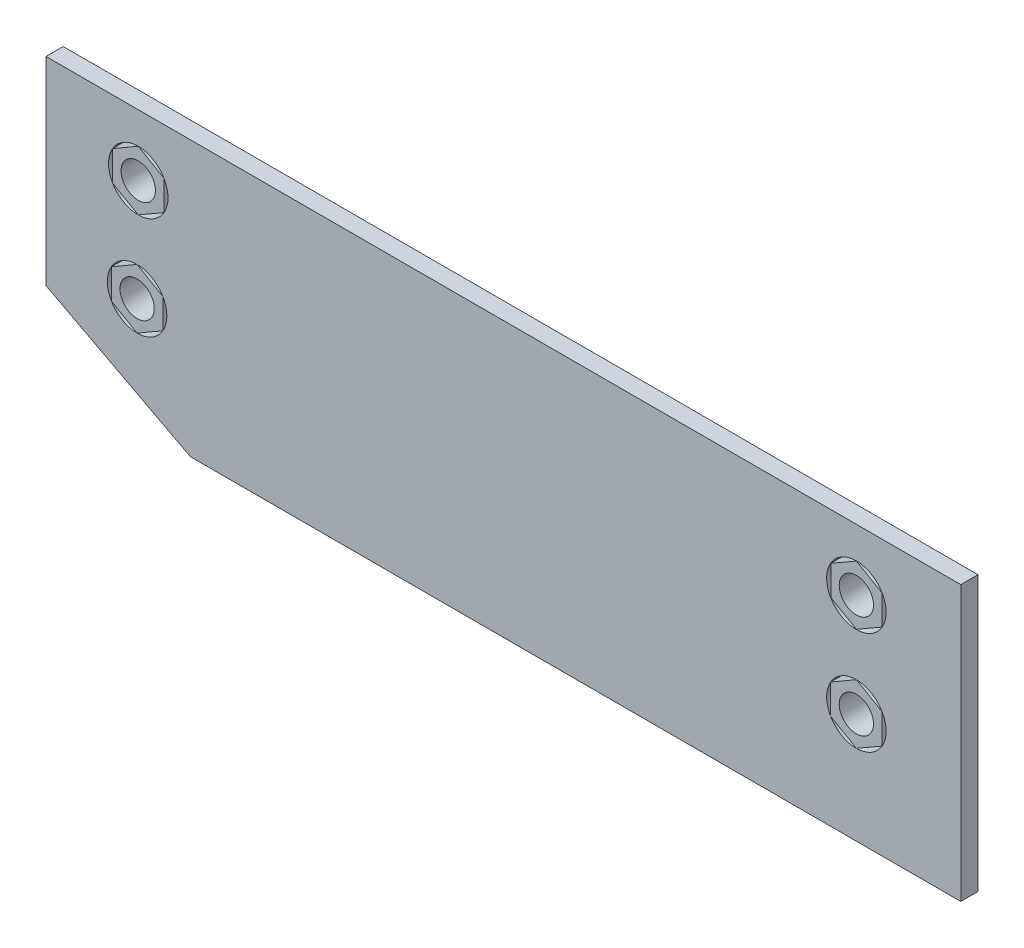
ISO-10303-21;
HEADER;
FILE_DESCRIPTION(('STEP AP214'),'2;1');
FILE_NAME('part.step','',(''),(''),'','','');
FILE_SCHEMA(('AUTOMOTIVE_DESIGN { 1 0 10303 214 1 1 1 1 }'));
ENDSEC;
DATA;
#1=APPLICATION_CONTEXT('core data for automotive mechanical design processes');
#2=APPLICATION_PROTOCOL_DEFINITION('international standard','automotive_design',2000,#1);
#3=PRODUCT_CONTEXT('',#1,'mechanical');
#4=PRODUCT('Part','Part','',(#3));
#5=PRODUCT_RELATED_PRODUCT_CATEGORY('part','',(#4));
#6=PRODUCT_DEFINITION_FORMATION('','',#4);
#7=PRODUCT_DEFINITION_CONTEXT('part definition',#1,'design');
#8=PRODUCT_DEFINITION('design','',#6,#7);
#9=PRODUCT_DEFINITION_SHAPE('','',#8);
#10=(LENGTH_UNIT() NAMED_UNIT(*) SI_UNIT(.MILLI.,.METRE.));
#11=(NAMED_UNIT(*) PLANE_ANGLE_UNIT() SI_UNIT($,.RADIAN.));
#12=(NAMED_UNIT(*) SI_UNIT($,.STERADIAN.) SOLID_ANGLE_UNIT());
#13=UNCERTAINTY_MEASURE_WITH_UNIT(LENGTH_MEASURE(1.E-05),#10,'distance_accuracy_value','');
#14=(GEOMETRIC_REPRESENTATION_CONTEXT(3) GLOBAL_UNCERTAINTY_ASSIGNED_CONTEXT((#13)) GLOBAL_UNIT_ASSIGNED_CONTEXT((#10,
#11,#12)) REPRESENTATION_CONTEXT('',''));
#15=CARTESIAN_POINT('',(0.,0.,0.));
#16=DIRECTION('',(0.,0.,1.));
#17=DIRECTION('',(1.,0.,0.));
#18=AXIS2_PLACEMENT_3D('',#15,#16,#17);
#19=CARTESIAN_POINT('',(-107.159098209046,4.12750000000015,0.));
#20=DIRECTION('',(-0.499999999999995,0.866025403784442,0.));
#21=DIRECTION('',(-0.866025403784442,-0.499999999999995,0.));
#22=AXIS2_PLACEMENT_3D('',#19,#20,#21);
#23=PLANE('',#22);
#24=DIRECTION('',(0.,0.,-1.));
#25=VECTOR('',#24,1.);
#26=CARTESIAN_POINT('',(-100.010058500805,8.25500000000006,0.));
#27=LINE('',#26,#25);
#28=CARTESIAN_POINT('',(-100.010058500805,8.25500000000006,0.));
#29=VERTEX_POINT('',#28);
#30=CARTESIAN_POINT('',(-100.010058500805,8.25500000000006,-7.3152));
#31=VERTEX_POINT('',#30);
#32=EDGE_CURVE('E65',#29,#31,#27,.T.);
#33=ORIENTED_EDGE('',*,*,#32,.T.);
#34=DIRECTION('',(0.866025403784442,0.499999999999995,0.));
#35=VECTOR('',#34,1.);
#36=CARTESIAN_POINT('',(-107.159098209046,4.12750000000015,-7.3152));
#37=LINE('',#36,#35);
#38=CARTESIAN_POINT('',(-107.159098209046,4.12750000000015,-7.3152));
#39=VERTEX_POINT('',#38);
#40=EDGE_CURVE('E114',#39,#31,#37,.T.);
#41=ORIENTED_EDGE('',*,*,#40,.F.);
#42=DIRECTION('',(0.,0.,-1.));
#43=VECTOR('',#42,1.);
#44=CARTESIAN_POINT('',(-107.159098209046,4.12750000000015,0.));
#45=LINE('',#44,#43);
#46=CARTESIAN_POINT('',(-107.159098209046,4.12750000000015,0.));
#47=VERTEX_POINT('',#46);
#48=EDGE_CURVE('E14',#47,#39,#45,.T.);
#49=ORIENTED_EDGE('',*,*,#48,.F.);
#50=DIRECTION('',(0.866025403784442,0.499999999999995,0.));
#51=VECTOR('',#50,1.);
#52=CARTESIAN_POINT('',(-107.159098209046,4.12750000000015,0.));
#53=LINE('',#52,#51);
#54=EDGE_CURVE('E115',#47,#29,#53,.T.);
#55=ORIENTED_EDGE('',*,*,#54,.T.);
#56=EDGE_LOOP('',(#33,#41,#49,#55));
#57=FACE_BOUND('',#56,.T.);
#58=ADVANCED_FACE('F62',(#57),#23,.T.);
#59=CARTESIAN_POINT('',(-107.159098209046,-4.12749999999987,0.));
#60=DIRECTION('',(-1.,0.,0.));
#61=DIRECTION('',(0.,-1.,0.));
#62=AXIS2_PLACEMENT_3D('',#59,#60,#61);
#63=PLANE('',#62);
#64=ORIENTED_EDGE('',*,*,#48,.T.);
#65=DIRECTION('',(0.,1.,0.));
#66=VECTOR('',#65,1.);
#67=CARTESIAN_POINT('',(-107.159098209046,-4.12749999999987,-7.3152));
#68=LINE('',#67,#66);
#69=CARTESIAN_POINT('',(-107.159098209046,-4.12749999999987,-7.3152));
#70=VERTEX_POINT('',#69);
#71=EDGE_CURVE('E133',#70,#39,#68,.T.);
#72=ORIENTED_EDGE('',*,*,#71,.F.);
#73=DIRECTION('',(0.,0.,-1.));
#74=VECTOR('',#73,1.);
#75=CARTESIAN_POINT('',(-107.159098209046,-4.12749999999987,0.));
#76=LINE('',#75,#74);
#77=CARTESIAN_POINT('',(-107.159098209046,-4.12749999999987,0.));
#78=VERTEX_POINT('',#77);
#79=EDGE_CURVE('E70',#78,#70,#76,.T.);
#80=ORIENTED_EDGE('',*,*,#79,.F.);
#81=DIRECTION('',(0.,1.,0.));
#82=VECTOR('',#81,1.);
#83=CARTESIAN_POINT('',(-107.159098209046,-4.12749999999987,0.));
#84=LINE('',#83,#82);
#85=EDGE_CURVE('E120',#78,#47,#84,.T.);
#86=ORIENTED_EDGE('',*,*,#85,.T.);
#87=EDGE_LOOP('',(#64,#72,#80,#86));
#88=FACE_BOUND('',#87,.T.);
#89=ADVANCED_FACE('F179',(#88),#63,.T.);
#90=CARTESIAN_POINT('',(-100.010058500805,-8.25499999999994,0.));
#91=DIRECTION('',(-0.500000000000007,-0.866025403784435,0.));
#92=DIRECTION('',(0.866025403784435,-0.500000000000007,0.));
#93=AXIS2_PLACEMENT_3D('',#90,#91,#92);
#94=PLANE('',#93);
#95=ORIENTED_EDGE('',*,*,#79,.T.);
#96=DIRECTION('',(-0.866025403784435,0.500000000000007,0.));
#97=VECTOR('',#96,1.);
#98=CARTESIAN_POINT('',(-100.010058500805,-8.25499999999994,-7.3152));
#99=LINE('',#98,#97);
#100=CARTESIAN_POINT('',(-100.010058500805,-8.25499999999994,-7.3152));
#101=VERTEX_POINT('',#100);
#102=EDGE_CURVE('E143',#101,#70,#99,.T.);
#103=ORIENTED_EDGE('',*,*,#102,.F.);
#104=DIRECTION('',(0.,0.,-1.));
#105=VECTOR('',#104,1.);
#106=CARTESIAN_POINT('',(-100.010058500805,-8.25499999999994,0.));
#107=LINE('',#106,#105);
#108=CARTESIAN_POINT('',(-100.010058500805,-8.25499999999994,0.));
#109=VERTEX_POINT('',#108);
#110=EDGE_CURVE('E162',#109,#101,#107,.T.);
#111=ORIENTED_EDGE('',*,*,#110,.F.);
#112=DIRECTION('',(-0.866025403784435,0.500000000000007,0.));
#113=VECTOR('',#112,1.);
#114=CARTESIAN_POINT('',(-100.010058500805,-8.25499999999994,0.));
#115=LINE('',#114,#113);
#116=EDGE_CURVE('E158',#109,#78,#115,.T.);
#117=ORIENTED_EDGE('',*,*,#116,.T.);
#118=EDGE_LOOP('',(#95,#103,#111,#117));
#119=FACE_BOUND('',#118,.T.);
#120=ADVANCED_FACE('F175',(#119),#94,.T.);
#121=CARTESIAN_POINT('',(-92.8610187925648,-4.12749999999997,0.));
#122=DIRECTION('',(0.499999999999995,-0.866025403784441,0.));
#123=DIRECTION('',(0.866025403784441,0.499999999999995,0.));
#124=AXIS2_PLACEMENT_3D('',#121,#122,#123);
#125=PLANE('',#124);
#126=ORIENTED_EDGE('',*,*,#110,.T.);
#127=DIRECTION('',(-0.866025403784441,-0.499999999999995,0.));
#128=VECTOR('',#127,1.);
#129=CARTESIAN_POINT('',(-92.8610187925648,-4.12749999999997,-7.3152));
#130=LINE('',#129,#128);
#131=CARTESIAN_POINT('',(-92.8610187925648,-4.12749999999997,-7.3152));
#132=VERTEX_POINT('',#131);
#133=EDGE_CURVE('E140',#132,#101,#130,.T.);
#134=ORIENTED_EDGE('',*,*,#133,.F.);
#135=DIRECTION('',(0.,0.,-1.));
#136=VECTOR('',#135,1.);
#137=CARTESIAN_POINT('',(-92.8610187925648,-4.12749999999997,0.));
#138=LINE('',#137,#136);
#139=CARTESIAN_POINT('',(-92.8610187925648,-4.12749999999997,0.));
#140=VERTEX_POINT('',#139);
#141=EDGE_CURVE('E164',#140,#132,#138,.T.);
#142=ORIENTED_EDGE('',*,*,#141,.F.);
#143=DIRECTION('',(-0.866025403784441,-0.499999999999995,0.));
#144=VECTOR('',#143,1.);
#145=CARTESIAN_POINT('',(-92.8610187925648,-4.12749999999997,0.));
#146=LINE('',#145,#144);
#147=EDGE_CURVE('E155',#140,#109,#146,.T.);
#148=ORIENTED_EDGE('',*,*,#147,.T.);
#149=EDGE_LOOP('',(#126,#134,#142,#148));
#150=FACE_BOUND('',#149,.T.);
#151=ADVANCED_FACE('F172',(#150),#125,.T.);
#152=CARTESIAN_POINT('',(-92.8610187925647,4.12750000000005,0.));
#153=DIRECTION('',(1.,0.,0.));
#154=DIRECTION('',(0.,1.,0.));
#155=AXIS2_PLACEMENT_3D('',#152,#153,#154);
#156=PLANE('',#155);
#157=ORIENTED_EDGE('',*,*,#141,.T.);
#158=DIRECTION('',(0.,-1.,0.));
#159=VECTOR('',#158,1.);
#160=CARTESIAN_POINT('',(-92.8610187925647,4.12750000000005,-7.3152));
#161=LINE('',#160,#159);
#162=CARTESIAN_POINT('',(-92.8610187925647,4.12750000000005,-7.3152));
#163=VERTEX_POINT('',#162);
#164=EDGE_CURVE('E127',#163,#132,#161,.T.);
#165=ORIENTED_EDGE('',*,*,#164,.F.);
#166=DIRECTION('',(0.,0.,-1.));
#167=VECTOR('',#166,1.);
#168=CARTESIAN_POINT('',(-92.8610187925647,4.12750000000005,0.));
#169=LINE('',#168,#167);
#170=CARTESIAN_POINT('',(-92.8610187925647,4.12750000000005,0.));
#171=VERTEX_POINT('',#170);
#172=EDGE_CURVE('E119',#171,#163,#169,.T.);
#173=ORIENTED_EDGE('',*,*,#172,.F.);
#174=DIRECTION('',(0.,-1.,0.));
#175=VECTOR('',#174,1.);
#176=CARTESIAN_POINT('',(-92.8610187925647,4.12750000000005,0.));
#177=LINE('',#176,#175);
#178=EDGE_CURVE('E152',#171,#140,#177,.T.);
#179=ORIENTED_EDGE('',*,*,#178,.T.);
#180=EDGE_LOOP('',(#157,#165,#173,#179));
#181=FACE_BOUND('',#180,.T.);
#182=ADVANCED_FACE('F166',(#181),#156,.T.);
#183=CARTESIAN_POINT('',(-100.010058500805,8.25500000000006,0.));
#184=DIRECTION('',(0.500000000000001,0.866025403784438,0.));
#185=DIRECTION('',(-0.866025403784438,0.500000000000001,0.));
#186=AXIS2_PLACEMENT_3D('',#183,#184,#185);
#187=PLANE('',#186);
#188=ORIENTED_EDGE('',*,*,#172,.T.);
#189=DIRECTION('',(0.866025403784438,-0.500000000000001,0.));
#190=VECTOR('',#189,1.);
#191=CARTESIAN_POINT('',(-100.010058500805,8.25500000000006,-7.3152));
#192=LINE('',#191,#190);
#193=EDGE_CURVE('E122',#31,#163,#192,.T.);
#194=ORIENTED_EDGE('',*,*,#193,.F.);
#195=ORIENTED_EDGE('',*,*,#32,.F.);
#196=DIRECTION('',(0.866025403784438,-0.500000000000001,0.));
#197=VECTOR('',#196,1.);
#198=CARTESIAN_POINT('',(-100.010058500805,8.25500000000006,0.));
#199=LINE('',#198,#197);
#200=EDGE_CURVE('E150',#29,#171,#199,.T.);
#201=ORIENTED_EDGE('',*,*,#200,.T.);
#202=EDGE_LOOP('',(#188,#194,#195,#201));
#203=FACE_BOUND('',#202,.T.);
#204=ADVANCED_FACE('F123',(#203),#187,.T.);
#205=CARTESIAN_POINT('',(0.,0.,0.));
#206=DIRECTION('',(0.,0.,-1.));
#207=DIRECTION('',(-1.,0.,0.));
#208=AXIS2_PLACEMENT_3D('',#205,#206,#207);
#209=PLANE('',#208);
#210=CARTESIAN_POINT('',(-100.010058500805,0.,0.));
#211=DIRECTION('',(0.,0.,-1.));
#212=DIRECTION('',(-1.,0.,0.));
#213=AXIS2_PLACEMENT_3D('',#210,#211,#212);
#214=CIRCLE('',#213,4.7625);
#215=CARTESIAN_POINT('',(-104.772558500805,0.,0.));
#216=VERTEX_POINT('',#215);
#217=EDGE_CURVE('E146',#216,#216,#214,.T.);
#218=ORIENTED_EDGE('',*,*,#217,.T.);
#219=EDGE_LOOP('',(#218));
#220=FACE_BOUND('',#219,.T.);
#221=ORIENTED_EDGE('',*,*,#54,.F.);
#222=ORIENTED_EDGE('',*,*,#85,.F.);
#223=ORIENTED_EDGE('',*,*,#116,.F.);
#224=ORIENTED_EDGE('',*,*,#147,.F.);
#225=ORIENTED_EDGE('',*,*,#178,.F.);
#226=ORIENTED_EDGE('',*,*,#200,.F.);
#227=EDGE_LOOP('',(#221,#222,#223,#224,#225,#226));
#228=FACE_BOUND('',#227,.T.);
#229=ADVANCED_FACE('F178',(#220,#228),#209,.F.);
#230=CARTESIAN_POINT('',(-100.010058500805,0.,0.));
#231=DIRECTION('',(0.,0.,-1.));
#232=DIRECTION('',(-1.,0.,0.));
#233=AXIS2_PLACEMENT_3D('',#230,#231,#232);
#234=CYLINDRICAL_SURFACE('',#233,4.7625);
#235=ORIENTED_EDGE('',*,*,#217,.F.);
#236=EDGE_LOOP('',(#235));
#237=FACE_BOUND('',#236,.T.);
#238=CARTESIAN_POINT('',(-100.010058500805,0.,-7.3152));
#239=DIRECTION('',(0.,0.,-1.));
#240=DIRECTION('',(-1.,0.,0.));
#241=AXIS2_PLACEMENT_3D('',#238,#239,#240);
#242=CIRCLE('',#241,4.7625);
#243=CARTESIAN_POINT('',(-104.772558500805,0.,-7.3152));
#244=VERTEX_POINT('',#243);
#245=EDGE_CURVE('E134',#244,#244,#242,.T.);
#246=ORIENTED_EDGE('',*,*,#245,.T.);
#247=EDGE_LOOP('',(#246));
#248=FACE_BOUND('',#247,.T.);
#249=ADVANCED_FACE('F197',(#237,#248),#234,.F.);
#250=CARTESIAN_POINT('',(0.,0.,-7.3152));
#251=DIRECTION('',(0.,0.,-1.));
#252=DIRECTION('',(-1.,0.,0.));
#253=AXIS2_PLACEMENT_3D('',#250,#251,#252);
#254=PLANE('',#253);
#255=ORIENTED_EDGE('',*,*,#40,.T.);
#256=ORIENTED_EDGE('',*,*,#193,.T.);
#257=ORIENTED_EDGE('',*,*,#164,.T.);
#258=ORIENTED_EDGE('',*,*,#133,.T.);
#259=ORIENTED_EDGE('',*,*,#102,.T.);
#260=ORIENTED_EDGE('',*,*,#71,.T.);
#261=EDGE_LOOP('',(#255,#256,#257,#258,#259,#260));
#262=FACE_BOUND('',#261,.T.);
#263=ORIENTED_EDGE('',*,*,#245,.F.);
#264=EDGE_LOOP('',(#263));
#265=FACE_BOUND('',#264,.T.);
#266=ADVANCED_FACE('F130',(#262,#265),#254,.T.);
#267=CLOSED_SHELL('',(#58,#89,#120,#151,#182,#204,#229,#249,#266));
#268=MANIFOLD_SOLID_BREP('B2',#267);
#269=CARTESIAN_POINT('',(-106.84403970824,32.7025000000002,0.));
#270=DIRECTION('',(-0.499999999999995,0.866025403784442,0.));
#271=DIRECTION('',(-0.866025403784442,-0.499999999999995,0.));
#272=AXIS2_PLACEMENT_3D('',#269,#270,#271);
#273=PLANE('',#272);
#274=DIRECTION('',(0.,0.,-1.));
#275=VECTOR('',#274,1.);
#276=CARTESIAN_POINT('',(-99.6949999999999,36.8300000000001,0.));
#277=LINE('',#276,#275);
#278=CARTESIAN_POINT('',(-99.6949999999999,36.8300000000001,0.));
#279=VERTEX_POINT('',#278);
#280=CARTESIAN_POINT('',(-99.6949999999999,36.8300000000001,-7.3152));
#281=VERTEX_POINT('',#280);
#282=EDGE_CURVE('E256',#279,#281,#277,.T.);
#283=ORIENTED_EDGE('',*,*,#282,.T.);
#284=DIRECTION('',(0.866025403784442,0.499999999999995,0.));
#285=VECTOR('',#284,1.);
#286=CARTESIAN_POINT('',(-106.84403970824,32.7025000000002,-7.3152));
#287=LINE('',#286,#285);
#288=CARTESIAN_POINT('',(-106.84403970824,32.7025000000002,-7.3152));
#289=VERTEX_POINT('',#288);
#290=EDGE_CURVE('E305',#289,#281,#287,.T.);
#291=ORIENTED_EDGE('',*,*,#290,.F.);
#292=DIRECTION('',(0.,0.,-1.));
#293=VECTOR('',#292,1.);
#294=CARTESIAN_POINT('',(-106.84403970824,32.7025000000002,0.));
#295=LINE('',#294,#293);
#296=CARTESIAN_POINT('',(-106.84403970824,32.7025000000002,0.));
#297=VERTEX_POINT('',#296);
#298=EDGE_CURVE('E60',#297,#289,#295,.T.);
#299=ORIENTED_EDGE('',*,*,#298,.F.);
#300=DIRECTION('',(0.866025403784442,0.499999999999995,0.));
#301=VECTOR('',#300,1.);
#302=CARTESIAN_POINT('',(-106.84403970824,32.7025000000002,0.));
#303=LINE('',#302,#301);
#304=EDGE_CURVE('E306',#297,#279,#303,.T.);
#305=ORIENTED_EDGE('',*,*,#304,.T.);
#306=EDGE_LOOP('',(#283,#291,#299,#305));
#307=FACE_BOUND('',#306,.T.);
#308=ADVANCED_FACE('F253',(#307),#273,.T.);
#309=CARTESIAN_POINT('',(-106.84403970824,24.4475000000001,0.));
#310=DIRECTION('',(-1.,0.,0.));
#311=DIRECTION('',(0.,-1.,0.));
#312=AXIS2_PLACEMENT_3D('',#309,#310,#311);
#313=PLANE('',#312);
#314=ORIENTED_EDGE('',*,*,#298,.T.);
#315=DIRECTION('',(0.,1.,0.));
#316=VECTOR('',#315,1.);
#317=CARTESIAN_POINT('',(-106.84403970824,24.4475000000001,-7.3152));
#318=LINE('',#317,#316);
#319=CARTESIAN_POINT('',(-106.84403970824,24.4475000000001,-7.3152));
#320=VERTEX_POINT('',#319);
#321=EDGE_CURVE('E324',#320,#289,#318,.T.);
#322=ORIENTED_EDGE('',*,*,#321,.F.);
#323=DIRECTION('',(0.,0.,-1.));
#324=VECTOR('',#323,1.);
#325=CARTESIAN_POINT('',(-106.84403970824,24.4475000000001,0.));
#326=LINE('',#325,#324);
#327=CARTESIAN_POINT('',(-106.84403970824,24.4475000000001,0.));
#328=VERTEX_POINT('',#327);
#329=EDGE_CURVE('E261',#328,#320,#326,.T.);
#330=ORIENTED_EDGE('',*,*,#329,.F.);
#331=DIRECTION('',(0.,1.,0.));
#332=VECTOR('',#331,1.);
#333=CARTESIAN_POINT('',(-106.84403970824,24.4475000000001,0.));
#334=LINE('',#333,#332);
#335=EDGE_CURVE('E311',#328,#297,#334,.T.);
#336=ORIENTED_EDGE('',*,*,#335,.T.);
#337=EDGE_LOOP('',(#314,#322,#330,#336));
#338=FACE_BOUND('',#337,.T.);
#339=ADVANCED_FACE('F370',(#338),#313,.T.);
#340=CARTESIAN_POINT('',(-99.6949999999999,20.3200000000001,0.));
#341=DIRECTION('',(-0.500000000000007,-0.866025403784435,0.));
#342=DIRECTION('',(0.866025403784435,-0.500000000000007,0.));
#343=AXIS2_PLACEMENT_3D('',#340,#341,#342);
#344=PLANE('',#343);
#345=ORIENTED_EDGE('',*,*,#329,.T.);
#346=DIRECTION('',(-0.866025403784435,0.500000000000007,0.));
#347=VECTOR('',#346,1.);
#348=CARTESIAN_POINT('',(-99.6949999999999,20.3200000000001,-7.3152));
#349=LINE('',#348,#347);
#350=CARTESIAN_POINT('',(-99.6949999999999,20.3200000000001,-7.3152));
#351=VERTEX_POINT('',#350);
#352=EDGE_CURVE('E334',#351,#320,#349,.T.);
#353=ORIENTED_EDGE('',*,*,#352,.F.);
#354=DIRECTION('',(0.,0.,-1.));
#355=VECTOR('',#354,1.);
#356=CARTESIAN_POINT('',(-99.6949999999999,20.3200000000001,0.));
#357=LINE('',#356,#355);
#358=CARTESIAN_POINT('',(-99.6949999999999,20.3200000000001,0.));
#359=VERTEX_POINT('',#358);
#360=EDGE_CURVE('E353',#359,#351,#357,.T.);
#361=ORIENTED_EDGE('',*,*,#360,.F.);
#362=DIRECTION('',(-0.866025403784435,0.500000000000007,0.));
#363=VECTOR('',#362,1.);
#364=CARTESIAN_POINT('',(-99.6949999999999,20.3200000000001,0.));
#365=LINE('',#364,#363);
#366=EDGE_CURVE('E349',#359,#328,#365,.T.);
#367=ORIENTED_EDGE('',*,*,#366,.T.);
#368=EDGE_LOOP('',(#345,#353,#361,#367));
#369=FACE_BOUND('',#368,.T.);
#370=ADVANCED_FACE('F366',(#369),#344,.T.);
#371=CARTESIAN_POINT('',(-92.5459602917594,24.4475,0.));
#372=DIRECTION('',(0.499999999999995,-0.866025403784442,0.));
#373=DIRECTION('',(0.866025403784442,0.499999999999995,0.));
#374=AXIS2_PLACEMENT_3D('',#371,#372,#373);
#375=PLANE('',#374);
#376=ORIENTED_EDGE('',*,*,#360,.T.);
#377=DIRECTION('',(-0.866025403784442,-0.499999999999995,0.));
#378=VECTOR('',#377,1.);
#379=CARTESIAN_POINT('',(-92.5459602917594,24.4475,-7.3152));
#380=LINE('',#379,#378);
#381=CARTESIAN_POINT('',(-92.5459602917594,24.4475,-7.3152));
#382=VERTEX_POINT('',#381);
#383=EDGE_CURVE('E331',#382,#351,#380,.T.);
#384=ORIENTED_EDGE('',*,*,#383,.F.);
#385=DIRECTION('',(0.,0.,-1.));
#386=VECTOR('',#385,1.);
#387=CARTESIAN_POINT('',(-92.5459602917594,24.4475,0.));
#388=LINE('',#387,#386);
#389=CARTESIAN_POINT('',(-92.5459602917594,24.4475,0.));
#390=VERTEX_POINT('',#389);
#391=EDGE_CURVE('E355',#390,#382,#388,.T.);
#392=ORIENTED_EDGE('',*,*,#391,.F.);
#393=DIRECTION('',(-0.866025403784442,-0.499999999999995,0.));
#394=VECTOR('',#393,1.);
#395=CARTESIAN_POINT('',(-92.5459602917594,24.4475,0.));
#396=LINE('',#395,#394);
#397=EDGE_CURVE('E346',#390,#359,#396,.T.);
#398=ORIENTED_EDGE('',*,*,#397,.T.);
#399=EDGE_LOOP('',(#376,#384,#392,#398));
#400=FACE_BOUND('',#399,.T.);
#401=ADVANCED_FACE('F363',(#400),#375,.T.);
#402=CARTESIAN_POINT('',(-92.5459602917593,32.7025000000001,0.));
#403=DIRECTION('',(1.,0.,0.));
#404=DIRECTION('',(0.,1.,0.));
#405=AXIS2_PLACEMENT_3D('',#402,#403,#404);
#406=PLANE('',#405);
#407=ORIENTED_EDGE('',*,*,#391,.T.);
#408=DIRECTION('',(0.,-1.,0.));
#409=VECTOR('',#408,1.);
#410=CARTESIAN_POINT('',(-92.5459602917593,32.7025000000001,-7.3152));
#411=LINE('',#410,#409);
#412=CARTESIAN_POINT('',(-92.5459602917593,32.7025000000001,-7.3152));
#413=VERTEX_POINT('',#412);
#414=EDGE_CURVE('E318',#413,#382,#411,.T.);
#415=ORIENTED_EDGE('',*,*,#414,.F.);
#416=DIRECTION('',(0.,0.,-1.));
#417=VECTOR('',#416,1.);
#418=CARTESIAN_POINT('',(-92.5459602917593,32.7025000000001,0.));
#419=LINE('',#418,#417);
#420=CARTESIAN_POINT('',(-92.5459602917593,32.7025000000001,0.));
#421=VERTEX_POINT('',#420);
#422=EDGE_CURVE('E310',#421,#413,#419,.T.);
#423=ORIENTED_EDGE('',*,*,#422,.F.);
#424=DIRECTION('',(0.,-1.,0.));
#425=VECTOR('',#424,1.);
#426=CARTESIAN_POINT('',(-92.5459602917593,32.7025000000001,0.));
#427=LINE('',#426,#425);
#428=EDGE_CURVE('E343',#421,#390,#427,.T.);
#429=ORIENTED_EDGE('',*,*,#428,.T.);
#430=EDGE_LOOP('',(#407,#415,#423,#429));
#431=FACE_BOUND('',#430,.T.);
#432=ADVANCED_FACE('F357',(#431),#406,.T.);
#433=CARTESIAN_POINT('',(-99.6949999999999,36.8300000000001,0.));
#434=DIRECTION('',(0.500000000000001,0.866025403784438,0.));
#435=DIRECTION('',(-0.866025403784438,0.500000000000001,0.));
#436=AXIS2_PLACEMENT_3D('',#433,#434,#435);
#437=PLANE('',#436);
#438=ORIENTED_EDGE('',*,*,#422,.T.);
#439=DIRECTION('',(0.866025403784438,-0.500000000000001,0.));
#440=VECTOR('',#439,1.);
#441=CARTESIAN_POINT('',(-99.6949999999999,36.8300000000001,-7.3152));
#442=LINE('',#441,#440);
#443=EDGE_CURVE('E313',#281,#413,#442,.T.);
#444=ORIENTED_EDGE('',*,*,#443,.F.);
#445=ORIENTED_EDGE('',*,*,#282,.F.);
#446=DIRECTION('',(0.866025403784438,-0.500000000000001,0.));
#447=VECTOR('',#446,1.);
#448=CARTESIAN_POINT('',(-99.6949999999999,36.8300000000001,0.));
#449=LINE('',#448,#447);
#450=EDGE_CURVE('E341',#279,#421,#449,.T.);
#451=ORIENTED_EDGE('',*,*,#450,.T.);
#452=EDGE_LOOP('',(#438,#444,#445,#451));
#453=FACE_BOUND('',#452,.T.);
#454=ADVANCED_FACE('F314',(#453),#437,.T.);
#455=CARTESIAN_POINT('',(0.,0.,0.));
#456=DIRECTION('',(0.,0.,-1.));
#457=DIRECTION('',(-1.,0.,0.));
#458=AXIS2_PLACEMENT_3D('',#455,#456,#457);
#459=PLANE('',#458);
#460=CARTESIAN_POINT('',(-99.6949999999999,28.5750000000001,0.));
#461=DIRECTION('',(0.,0.,-1.));
#462=DIRECTION('',(-1.,0.,0.));
#463=AXIS2_PLACEMENT_3D('',#460,#461,#462);
#464=CIRCLE('',#463,4.7625);
#465=CARTESIAN_POINT('',(-104.4575,28.5750000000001,0.));
#466=VERTEX_POINT('',#465);
#467=EDGE_CURVE('E337',#466,#466,#464,.T.);
#468=ORIENTED_EDGE('',*,*,#467,.T.);
#469=EDGE_LOOP('',(#468));
#470=FACE_BOUND('',#469,.T.);
#471=ORIENTED_EDGE('',*,*,#304,.F.);
#472=ORIENTED_EDGE('',*,*,#335,.F.);
#473=ORIENTED_EDGE('',*,*,#366,.F.);
#474=ORIENTED_EDGE('',*,*,#397,.F.);
#475=ORIENTED_EDGE('',*,*,#428,.F.);
#476=ORIENTED_EDGE('',*,*,#450,.F.);
#477=EDGE_LOOP('',(#471,#472,#473,#474,#475,#476));
#478=FACE_BOUND('',#477,.T.);
#479=ADVANCED_FACE('F369',(#470,#478),#459,.F.);
#480=CARTESIAN_POINT('',(-99.6949999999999,28.5750000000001,0.));
#481=DIRECTION('',(0.,0.,-1.));
#482=DIRECTION('',(-1.,0.,0.));
#483=AXIS2_PLACEMENT_3D('',#480,#481,#482);
#484=CYLINDRICAL_SURFACE('',#483,4.7625);
#485=ORIENTED_EDGE('',*,*,#467,.F.);
#486=EDGE_LOOP('',(#485));
#487=FACE_BOUND('',#486,.T.);
#488=CARTESIAN_POINT('',(-99.6949999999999,28.5750000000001,-7.3152));
#489=DIRECTION('',(0.,0.,-1.));
#490=DIRECTION('',(-1.,0.,0.));
#491=AXIS2_PLACEMENT_3D('',#488,#489,#490);
#492=CIRCLE('',#491,4.7625);
#493=CARTESIAN_POINT('',(-104.4575,28.5750000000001,-7.3152));
#494=VERTEX_POINT('',#493);
#495=EDGE_CURVE('E325',#494,#494,#492,.T.);
#496=ORIENTED_EDGE('',*,*,#495,.T.);
#497=EDGE_LOOP('',(#496));
#498=FACE_BOUND('',#497,.T.);
#499=ADVANCED_FACE('F388',(#487,#498),#484,.F.);
#500=CARTESIAN_POINT('',(0.,0.,-7.31520000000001));
#501=DIRECTION('',(0.,0.,-1.));
#502=DIRECTION('',(-1.,0.,0.));
#503=AXIS2_PLACEMENT_3D('',#500,#501,#502);
#504=PLANE('',#503);
#505=ORIENTED_EDGE('',*,*,#290,.T.);
#506=ORIENTED_EDGE('',*,*,#443,.T.);
#507=ORIENTED_EDGE('',*,*,#414,.T.);
#508=ORIENTED_EDGE('',*,*,#383,.T.);
#509=ORIENTED_EDGE('',*,*,#352,.T.);
#510=ORIENTED_EDGE('',*,*,#321,.T.);
#511=EDGE_LOOP('',(#505,#506,#507,#508,#509,#510));
#512=FACE_BOUND('',#511,.T.);
#513=ORIENTED_EDGE('',*,*,#495,.F.);
#514=EDGE_LOOP('',(#513));
#515=FACE_BOUND('',#514,.T.);
#516=ADVANCED_FACE('F321',(#512,#515),#504,.T.);
#517=CLOSED_SHELL('',(#308,#339,#370,#401,#432,#454,#479,#499,#516));
#518=MANIFOLD_SOLID_BREP('B8',#517);
#519=CARTESIAN_POINT('',(92.5459602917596,4.12750000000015,0.));
#520=DIRECTION('',(-0.499999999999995,0.866025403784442,0.));
#521=DIRECTION('',(-0.866025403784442,-0.499999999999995,0.));
#522=AXIS2_PLACEMENT_3D('',#519,#520,#521);
#523=PLANE('',#522);
#524=DIRECTION('',(0.,0.,-1.));
#525=VECTOR('',#524,1.);
#526=CARTESIAN_POINT('',(99.6950000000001,8.25500000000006,0.));
#527=LINE('',#526,#525);
#528=CARTESIAN_POINT('',(99.6950000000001,8.25500000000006,0.));
#529=VERTEX_POINT('',#528);
#530=CARTESIAN_POINT('',(99.6950000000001,8.25500000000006,-7.3152));
#531=VERTEX_POINT('',#530);
#532=EDGE_CURVE('E451',#529,#531,#527,.T.);
#533=ORIENTED_EDGE('',*,*,#532,.T.);
#534=DIRECTION('',(0.866025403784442,0.499999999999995,0.));
#535=VECTOR('',#534,1.);
#536=CARTESIAN_POINT('',(92.5459602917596,4.12750000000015,-7.3152));
#537=LINE('',#536,#535);
#538=CARTESIAN_POINT('',(92.5459602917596,4.12750000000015,-7.3152));
#539=VERTEX_POINT('',#538);
#540=EDGE_CURVE('E500',#539,#531,#537,.T.);
#541=ORIENTED_EDGE('',*,*,#540,.F.);
#542=DIRECTION('',(0.,0.,-1.));
#543=VECTOR('',#542,1.);
#544=CARTESIAN_POINT('',(92.5459602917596,4.12750000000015,0.));
#545=LINE('',#544,#543);
#546=CARTESIAN_POINT('',(92.5459602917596,4.12750000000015,0.));
#547=VERTEX_POINT('',#546);
#548=EDGE_CURVE('E251',#547,#539,#545,.T.);
#549=ORIENTED_EDGE('',*,*,#548,.F.);
#550=DIRECTION('',(0.866025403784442,0.499999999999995,0.));
#551=VECTOR('',#550,1.);
#552=CARTESIAN_POINT('',(92.5459602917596,4.12750000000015,0.));
#553=LINE('',#552,#551);
#554=EDGE_CURVE('E501',#547,#529,#553,.T.);
#555=ORIENTED_EDGE('',*,*,#554,.T.);
#556=EDGE_LOOP('',(#533,#541,#549,#555));
#557=FACE_BOUND('',#556,.T.);
#558=ADVANCED_FACE('F448',(#557),#523,.T.);
#559=CARTESIAN_POINT('',(92.5459602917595,-4.12749999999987,0.));
#560=DIRECTION('',(-1.,0.,0.));
#561=DIRECTION('',(0.,-1.,0.));
#562=AXIS2_PLACEMENT_3D('',#559,#560,#561);
#563=PLANE('',#562);
#564=ORIENTED_EDGE('',*,*,#548,.T.);
#565=DIRECTION('',(0.,1.,0.));
#566=VECTOR('',#565,1.);
#567=CARTESIAN_POINT('',(92.5459602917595,-4.12749999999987,-7.3152));
#568=LINE('',#567,#566);
#569=CARTESIAN_POINT('',(92.5459602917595,-4.12749999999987,-7.3152));
#570=VERTEX_POINT('',#569);
#571=EDGE_CURVE('E519',#570,#539,#568,.T.);
#572=ORIENTED_EDGE('',*,*,#571,.F.);
#573=DIRECTION('',(0.,0.,-1.));
#574=VECTOR('',#573,1.);
#575=CARTESIAN_POINT('',(92.5459602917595,-4.12749999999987,0.));
#576=LINE('',#575,#574);
#577=CARTESIAN_POINT('',(92.5459602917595,-4.12749999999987,0.));
#578=VERTEX_POINT('',#577);
#579=EDGE_CURVE('E456',#578,#570,#576,.T.);
#580=ORIENTED_EDGE('',*,*,#579,.F.);
#581=DIRECTION('',(0.,1.,0.));
#582=VECTOR('',#581,1.);
#583=CARTESIAN_POINT('',(92.5459602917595,-4.12749999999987,0.));
#584=LINE('',#583,#582);
#585=EDGE_CURVE('E506',#578,#547,#584,.T.);
#586=ORIENTED_EDGE('',*,*,#585,.T.);
#587=EDGE_LOOP('',(#564,#572,#580,#586));
#588=FACE_BOUND('',#587,.T.);
#589=ADVANCED_FACE('F565',(#588),#563,.T.);
#590=CARTESIAN_POINT('',(99.695,-8.25499999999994,0.));
#591=DIRECTION('',(-0.500000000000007,-0.866025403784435,0.));
#592=DIRECTION('',(0.866025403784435,-0.500000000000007,0.));
#593=AXIS2_PLACEMENT_3D('',#590,#591,#592);
#594=PLANE('',#593);
#595=ORIENTED_EDGE('',*,*,#579,.T.);
#596=DIRECTION('',(-0.866025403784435,0.500000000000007,0.));
#597=VECTOR('',#596,1.);
#598=CARTESIAN_POINT('',(99.695,-8.25499999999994,-7.3152));
#599=LINE('',#598,#597);
#600=CARTESIAN_POINT('',(99.695,-8.25499999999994,-7.3152));
#601=VERTEX_POINT('',#600);
#602=EDGE_CURVE('E529',#601,#570,#599,.T.);
#603=ORIENTED_EDGE('',*,*,#602,.F.);
#604=DIRECTION('',(0.,0.,-1.));
#605=VECTOR('',#604,1.);
#606=CARTESIAN_POINT('',(99.695,-8.25499999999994,0.));
#607=LINE('',#606,#605);
#608=CARTESIAN_POINT('',(99.695,-8.25499999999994,0.));
#609=VERTEX_POINT('',#608);
#610=EDGE_CURVE('E548',#609,#601,#607,.T.);
#611=ORIENTED_EDGE('',*,*,#610,.F.);
#612=DIRECTION('',(-0.866025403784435,0.500000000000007,0.));
#613=VECTOR('',#612,1.);
#614=CARTESIAN_POINT('',(99.695,-8.25499999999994,0.));
#615=LINE('',#614,#613);
#616=EDGE_CURVE('E544',#609,#578,#615,.T.);
#617=ORIENTED_EDGE('',*,*,#616,.T.);
#618=EDGE_LOOP('',(#595,#603,#611,#617));
#619=FACE_BOUND('',#618,.T.);
#620=ADVANCED_FACE('F561',(#619),#594,.T.);
#621=CARTESIAN_POINT('',(106.844039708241,-4.12749999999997,0.));
#622=DIRECTION('',(0.499999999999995,-0.866025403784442,0.));
#623=DIRECTION('',(0.866025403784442,0.499999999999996,0.));
#624=AXIS2_PLACEMENT_3D('',#621,#622,#623);
#625=PLANE('',#624);
#626=ORIENTED_EDGE('',*,*,#610,.T.);
#627=DIRECTION('',(-0.866025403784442,-0.499999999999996,0.));
#628=VECTOR('',#627,1.);
#629=CARTESIAN_POINT('',(106.844039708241,-4.12749999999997,-7.3152));
#630=LINE('',#629,#628);
#631=CARTESIAN_POINT('',(106.844039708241,-4.12749999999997,-7.3152));
#632=VERTEX_POINT('',#631);
#633=EDGE_CURVE('E526',#632,#601,#630,.T.);
#634=ORIENTED_EDGE('',*,*,#633,.F.);
#635=DIRECTION('',(0.,0.,-1.));
#636=VECTOR('',#635,1.);
#637=CARTESIAN_POINT('',(106.844039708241,-4.12749999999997,0.));
#638=LINE('',#637,#636);
#639=CARTESIAN_POINT('',(106.844039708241,-4.12749999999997,0.));
#640=VERTEX_POINT('',#639);
#641=EDGE_CURVE('E550',#640,#632,#638,.T.);
#642=ORIENTED_EDGE('',*,*,#641,.F.);
#643=DIRECTION('',(-0.866025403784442,-0.499999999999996,0.));
#644=VECTOR('',#643,1.);
#645=CARTESIAN_POINT('',(106.844039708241,-4.12749999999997,0.));
#646=LINE('',#645,#644);
#647=EDGE_CURVE('E541',#640,#609,#646,.T.);
#648=ORIENTED_EDGE('',*,*,#647,.T.);
#649=EDGE_LOOP('',(#626,#634,#642,#648));
#650=FACE_BOUND('',#649,.T.);
#651=ADVANCED_FACE('F558',(#650),#625,.T.);
#652=CARTESIAN_POINT('',(106.844039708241,4.12750000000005,0.));
#653=DIRECTION('',(1.,0.,0.));
#654=DIRECTION('',(0.,1.,0.));
#655=AXIS2_PLACEMENT_3D('',#652,#653,#654);
#656=PLANE('',#655);
#657=ORIENTED_EDGE('',*,*,#641,.T.);
#658=DIRECTION('',(0.,-1.,0.));
#659=VECTOR('',#658,1.);
#660=CARTESIAN_POINT('',(106.844039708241,4.12750000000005,-7.3152));
#661=LINE('',#660,#659);
#662=CARTESIAN_POINT('',(106.844039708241,4.12750000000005,-7.3152));
#663=VERTEX_POINT('',#662);
#664=EDGE_CURVE('E513',#663,#632,#661,.T.);
#665=ORIENTED_EDGE('',*,*,#664,.F.);
#666=DIRECTION('',(0.,0.,-1.));
#667=VECTOR('',#666,1.);
#668=CARTESIAN_POINT('',(106.844039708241,4.12750000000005,0.));
#669=LINE('',#668,#667);
#670=CARTESIAN_POINT('',(106.844039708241,4.12750000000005,0.));
#671=VERTEX_POINT('',#670);
#672=EDGE_CURVE('E505',#671,#663,#669,.T.);
#673=ORIENTED_EDGE('',*,*,#672,.F.);
#674=DIRECTION('',(0.,-1.,0.));
#675=VECTOR('',#674,1.);
#676=CARTESIAN_POINT('',(106.844039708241,4.12750000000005,0.));
#677=LINE('',#676,#675);
#678=EDGE_CURVE('E538',#671,#640,#677,.T.);
#679=ORIENTED_EDGE('',*,*,#678,.T.);
#680=EDGE_LOOP('',(#657,#665,#673,#679));
#681=FACE_BOUND('',#680,.T.);
#682=ADVANCED_FACE('F552',(#681),#656,.T.);
#683=CARTESIAN_POINT('',(99.6950000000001,8.25500000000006,0.));
#684=DIRECTION('',(0.500000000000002,0.866025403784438,0.));
#685=DIRECTION('',(-0.866025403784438,0.500000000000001,0.));
#686=AXIS2_PLACEMENT_3D('',#683,#684,#685);
#687=PLANE('',#686);
#688=ORIENTED_EDGE('',*,*,#672,.T.);
#689=DIRECTION('',(0.866025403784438,-0.500000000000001,0.));
#690=VECTOR('',#689,1.);
#691=CARTESIAN_POINT('',(99.6950000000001,8.25500000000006,-7.3152));
#692=LINE('',#691,#690);
#693=EDGE_CURVE('E508',#531,#663,#692,.T.);
#694=ORIENTED_EDGE('',*,*,#693,.F.);
#695=ORIENTED_EDGE('',*,*,#532,.F.);
#696=DIRECTION('',(0.866025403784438,-0.500000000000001,0.));
#697=VECTOR('',#696,1.);
#698=CARTESIAN_POINT('',(99.6950000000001,8.25500000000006,0.));
#699=LINE('',#698,#697);
#700=EDGE_CURVE('E536',#529,#671,#699,.T.);
#701=ORIENTED_EDGE('',*,*,#700,.T.);
#702=EDGE_LOOP('',(#688,#694,#695,#701));
#703=FACE_BOUND('',#702,.T.);
#704=ADVANCED_FACE('F509',(#703),#687,.T.);
#705=CARTESIAN_POINT('',(0.,0.,0.));
#706=DIRECTION('',(0.,0.,-1.));
#707=DIRECTION('',(-1.,0.,0.));
#708=AXIS2_PLACEMENT_3D('',#705,#706,#707);
#709=PLANE('',#708);
#710=CARTESIAN_POINT('',(99.6950000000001,0.,0.));
#711=DIRECTION('',(0.,0.,-1.));
#712=DIRECTION('',(-1.,0.,0.));
#713=AXIS2_PLACEMENT_3D('',#710,#711,#712);
#714=CIRCLE('',#713,4.7625);
#715=CARTESIAN_POINT('',(94.9325000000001,0.,0.));
#716=VERTEX_POINT('',#715);
#717=EDGE_CURVE('E532',#716,#716,#714,.T.);
#718=ORIENTED_EDGE('',*,*,#717,.T.);
#719=EDGE_LOOP('',(#718));
#720=FACE_BOUND('',#719,.T.);
#721=ORIENTED_EDGE('',*,*,#554,.F.);
#722=ORIENTED_EDGE('',*,*,#585,.F.);
#723=ORIENTED_EDGE('',*,*,#616,.F.);
#724=ORIENTED_EDGE('',*,*,#647,.F.);
#725=ORIENTED_EDGE('',*,*,#678,.F.);
#726=ORIENTED_EDGE('',*,*,#700,.F.);
#727=EDGE_LOOP('',(#721,#722,#723,#724,#725,#726));
#728=FACE_BOUND('',#727,.T.);
#729=ADVANCED_FACE('F564',(#720,#728),#709,.F.);
#730=CARTESIAN_POINT('',(99.6950000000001,0.,0.));
#731=DIRECTION('',(0.,0.,-1.));
#732=DIRECTION('',(-1.,0.,0.));
#733=AXIS2_PLACEMENT_3D('',#730,#731,#732);
#734=CYLINDRICAL_SURFACE('',#733,4.7625);
#735=ORIENTED_EDGE('',*,*,#717,.F.);
#736=EDGE_LOOP('',(#735));
#737=FACE_BOUND('',#736,.T.);
#738=CARTESIAN_POINT('',(99.6950000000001,0.,-7.3152));
#739=DIRECTION('',(0.,0.,-1.));
#740=DIRECTION('',(-1.,0.,0.));
#741=AXIS2_PLACEMENT_3D('',#738,#739,#740);
#742=CIRCLE('',#741,4.7625);
#743=CARTESIAN_POINT('',(94.9325000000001,0.,-7.3152));
#744=VERTEX_POINT('',#743);
#745=EDGE_CURVE('E520',#744,#744,#742,.T.);
#746=ORIENTED_EDGE('',*,*,#745,.T.);
#747=EDGE_LOOP('',(#746));
#748=FACE_BOUND('',#747,.T.);
#749=ADVANCED_FACE('F583',(#737,#748),#734,.F.);
#750=CARTESIAN_POINT('',(0.,0.,-7.31519999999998));
#751=DIRECTION('',(0.,0.,-1.));
#752=DIRECTION('',(-1.,0.,0.));
#753=AXIS2_PLACEMENT_3D('',#750,#751,#752);
#754=PLANE('',#753);
#755=ORIENTED_EDGE('',*,*,#540,.T.);
#756=ORIENTED_EDGE('',*,*,#693,.T.);
#757=ORIENTED_EDGE('',*,*,#664,.T.);
#758=ORIENTED_EDGE('',*,*,#633,.T.);
#759=ORIENTED_EDGE('',*,*,#602,.T.);
#760=ORIENTED_EDGE('',*,*,#571,.T.);
#761=EDGE_LOOP('',(#755,#756,#757,#758,#759,#760));
#762=FACE_BOUND('',#761,.T.);
#763=ORIENTED_EDGE('',*,*,#745,.F.);
#764=EDGE_LOOP('',(#763));
#765=FACE_BOUND('',#764,.T.);
#766=ADVANCED_FACE('F516',(#762,#765),#754,.T.);
#767=CLOSED_SHELL('',(#558,#589,#620,#651,#682,#704,#729,#749,#766));
#768=MANIFOLD_SOLID_BREP('B54',#767);
#769=CARTESIAN_POINT('',(92.5830000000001,32.6811151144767,0.));
#770=DIRECTION('',(-0.499999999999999,0.866025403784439,0.));
#771=DIRECTION('',(-0.866025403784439,-0.499999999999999,0.));
#772=AXIS2_PLACEMENT_3D('',#769,#770,#771);
#773=PLANE('',#772);
#774=DIRECTION('',(0.,0.,-1.));
#775=VECTOR('',#774,1.);
#776=CARTESIAN_POINT('',(99.6950000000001,36.7872302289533,0.));
#777=LINE('',#776,#775);
#778=CARTESIAN_POINT('',(99.6950000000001,36.7872302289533,0.));
#779=VERTEX_POINT('',#778);
#780=CARTESIAN_POINT('',(99.6950000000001,36.7872302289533,-7.3152));
#781=VERTEX_POINT('',#780);
#782=EDGE_CURVE('E639',#779,#781,#777,.T.);
#783=ORIENTED_EDGE('',*,*,#782,.T.);
#784=DIRECTION('',(0.866025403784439,0.499999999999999,0.));
#785=VECTOR('',#784,1.);
#786=CARTESIAN_POINT('',(92.5830000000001,32.6811151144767,-7.3152));
#787=LINE('',#786,#785);
#788=CARTESIAN_POINT('',(92.5830000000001,32.6811151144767,-7.3152));
#789=VERTEX_POINT('',#788);
#790=EDGE_CURVE('E688',#789,#781,#787,.T.);
#791=ORIENTED_EDGE('',*,*,#790,.F.);
#792=DIRECTION('',(0.,0.,-1.));
#793=VECTOR('',#792,1.);
#794=CARTESIAN_POINT('',(92.5830000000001,32.6811151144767,0.));
#795=LINE('',#794,#793);
#796=CARTESIAN_POINT('',(92.5830000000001,32.6811151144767,0.));
#797=VERTEX_POINT('',#796);
#798=EDGE_CURVE('E446',#797,#789,#795,.T.);
#799=ORIENTED_EDGE('',*,*,#798,.F.);
#800=DIRECTION('',(0.866025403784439,0.499999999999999,0.));
#801=VECTOR('',#800,1.);
#802=CARTESIAN_POINT('',(92.5830000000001,32.6811151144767,0.));
#803=LINE('',#802,#801);
#804=EDGE_CURVE('E689',#797,#779,#803,.T.);
#805=ORIENTED_EDGE('',*,*,#804,.T.);
#806=EDGE_LOOP('',(#783,#791,#799,#805));
#807=FACE_BOUND('',#806,.T.);
#808=ADVANCED_FACE('F636',(#807),#773,.T.);
#809=CARTESIAN_POINT('',(92.5830000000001,24.4688848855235,0.));
#810=DIRECTION('',(-1.,0.,0.));
#811=DIRECTION('',(0.,0.,1.));
#812=AXIS2_PLACEMENT_3D('',#809,#810,#811);
#813=PLANE('',#812);
#814=ORIENTED_EDGE('',*,*,#798,.T.);
#815=DIRECTION('',(0.,1.,0.));
#816=VECTOR('',#815,1.);
#817=CARTESIAN_POINT('',(92.5830000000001,24.4688848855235,-7.3152));
#818=LINE('',#817,#816);
#819=CARTESIAN_POINT('',(92.5830000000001,24.4688848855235,-7.3152));
#820=VERTEX_POINT('',#819);
#821=EDGE_CURVE('E707',#820,#789,#818,.T.);
#822=ORIENTED_EDGE('',*,*,#821,.F.);
#823=DIRECTION('',(0.,0.,-1.));
#824=VECTOR('',#823,1.);
#825=CARTESIAN_POINT('',(92.5830000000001,24.4688848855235,0.));
#826=LINE('',#825,#824);
#827=CARTESIAN_POINT('',(92.5830000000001,24.4688848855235,0.));
#828=VERTEX_POINT('',#827);
#829=EDGE_CURVE('E644',#828,#820,#826,.T.);
#830=ORIENTED_EDGE('',*,*,#829,.F.);
#831=DIRECTION('',(0.,1.,0.));
#832=VECTOR('',#831,1.);
#833=CARTESIAN_POINT('',(92.5830000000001,24.4688848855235,0.));
#834=LINE('',#833,#832);
#835=EDGE_CURVE('E694',#828,#797,#834,.T.);
#836=ORIENTED_EDGE('',*,*,#835,.T.);
#837=EDGE_LOOP('',(#814,#822,#830,#836));
#838=FACE_BOUND('',#837,.T.);
#839=ADVANCED_FACE('F753',(#838),#813,.T.);
#840=CARTESIAN_POINT('',(99.6950000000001,20.3627697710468,0.));
#841=DIRECTION('',(-0.5,-0.866025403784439,0.));
#842=DIRECTION('',(0.866025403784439,-0.5,0.));
#843=AXIS2_PLACEMENT_3D('',#840,#841,#842);
#844=PLANE('',#843);
#845=ORIENTED_EDGE('',*,*,#829,.T.);
#846=DIRECTION('',(-0.866025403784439,0.5,0.));
#847=VECTOR('',#846,1.);
#848=CARTESIAN_POINT('',(99.6950000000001,20.3627697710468,-7.3152));
#849=LINE('',#848,#847);
#850=CARTESIAN_POINT('',(99.6950000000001,20.3627697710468,-7.3152));
#851=VERTEX_POINT('',#850);
#852=EDGE_CURVE('E717',#851,#820,#849,.T.);
#853=ORIENTED_EDGE('',*,*,#852,.F.);
#854=DIRECTION('',(0.,0.,-1.));
#855=VECTOR('',#854,1.);
#856=CARTESIAN_POINT('',(99.6950000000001,20.3627697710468,0.));
#857=LINE('',#856,#855);
#858=CARTESIAN_POINT('',(99.6950000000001,20.3627697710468,0.));
#859=VERTEX_POINT('',#858);
#860=EDGE_CURVE('E736',#859,#851,#857,.T.);
#861=ORIENTED_EDGE('',*,*,#860,.F.);
#862=DIRECTION('',(-0.866025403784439,0.5,0.));
#863=VECTOR('',#862,1.);
#864=CARTESIAN_POINT('',(99.6950000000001,20.3627697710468,0.));
#865=LINE('',#864,#863);
#866=EDGE_CURVE('E732',#859,#828,#865,.T.);
#867=ORIENTED_EDGE('',*,*,#866,.T.);
#868=EDGE_LOOP('',(#845,#853,#861,#867));
#869=FACE_BOUND('',#868,.T.);
#870=ADVANCED_FACE('F749',(#869),#844,.T.);
#871=CARTESIAN_POINT('',(106.807,24.4688848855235,0.));
#872=DIRECTION('',(0.5,-0.866025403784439,0.));
#873=DIRECTION('',(0.866025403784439,0.5,0.));
#874=AXIS2_PLACEMENT_3D('',#871,#872,#873);
#875=PLANE('',#874);
#876=ORIENTED_EDGE('',*,*,#860,.T.);
#877=DIRECTION('',(-0.866025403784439,-0.5,0.));
#878=VECTOR('',#877,1.);
#879=CARTESIAN_POINT('',(106.807,24.4688848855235,-7.3152));
#880=LINE('',#879,#878);
#881=CARTESIAN_POINT('',(106.807,24.4688848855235,-7.3152));
#882=VERTEX_POINT('',#881);
#883=EDGE_CURVE('E714',#882,#851,#880,.T.);
#884=ORIENTED_EDGE('',*,*,#883,.F.);
#885=DIRECTION('',(0.,0.,-1.));
#886=VECTOR('',#885,1.);
#887=CARTESIAN_POINT('',(106.807,24.4688848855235,0.));
#888=LINE('',#887,#886);
#889=CARTESIAN_POINT('',(106.807,24.4688848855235,0.));
#890=VERTEX_POINT('',#889);
#891=EDGE_CURVE('E738',#890,#882,#888,.T.);
#892=ORIENTED_EDGE('',*,*,#891,.F.);
#893=DIRECTION('',(-0.866025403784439,-0.5,0.));
#894=VECTOR('',#893,1.);
#895=CARTESIAN_POINT('',(106.807,24.4688848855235,0.));
#896=LINE('',#895,#894);
#897=EDGE_CURVE('E729',#890,#859,#896,.T.);
#898=ORIENTED_EDGE('',*,*,#897,.T.);
#899=EDGE_LOOP('',(#876,#884,#892,#898));
#900=FACE_BOUND('',#899,.T.);
#901=ADVANCED_FACE('F746',(#900),#875,.T.);
#902=CARTESIAN_POINT('',(106.807,32.6811151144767,0.));
#903=DIRECTION('',(1.,0.,0.));
#904=DIRECTION('',(0.,0.,-1.));
#905=AXIS2_PLACEMENT_3D('',#902,#903,#904);
#906=PLANE('',#905);
#907=ORIENTED_EDGE('',*,*,#891,.T.);
#908=DIRECTION('',(0.,-1.,0.));
#909=VECTOR('',#908,1.);
#910=CARTESIAN_POINT('',(106.807,32.6811151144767,-7.3152));
#911=LINE('',#910,#909);
#912=CARTESIAN_POINT('',(106.807,32.6811151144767,-7.3152));
#913=VERTEX_POINT('',#912);
#914=EDGE_CURVE('E701',#913,#882,#911,.T.);
#915=ORIENTED_EDGE('',*,*,#914,.F.);
#916=DIRECTION('',(0.,0.,-1.));
#917=VECTOR('',#916,1.);
#918=CARTESIAN_POINT('',(106.807,32.6811151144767,0.));
#919=LINE('',#918,#917);
#920=CARTESIAN_POINT('',(106.807,32.6811151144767,0.));
#921=VERTEX_POINT('',#920);
#922=EDGE_CURVE('E693',#921,#913,#919,.T.);
#923=ORIENTED_EDGE('',*,*,#922,.F.);
#924=DIRECTION('',(0.,-1.,0.));
#925=VECTOR('',#924,1.);
#926=CARTESIAN_POINT('',(106.807,32.6811151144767,0.));
#927=LINE('',#926,#925);
#928=EDGE_CURVE('E726',#921,#890,#927,.T.);
#929=ORIENTED_EDGE('',*,*,#928,.T.);
#930=EDGE_LOOP('',(#907,#915,#923,#929));
#931=FACE_BOUND('',#930,.T.);
#932=ADVANCED_FACE('F740',(#931),#906,.T.);
#933=CARTESIAN_POINT('',(99.6950000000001,36.7872302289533,0.));
#934=DIRECTION('',(0.5,0.866025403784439,0.));
#935=DIRECTION('',(-0.866025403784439,0.5,0.));
#936=AXIS2_PLACEMENT_3D('',#933,#934,#935);
#937=PLANE('',#936);
#938=ORIENTED_EDGE('',*,*,#922,.T.);
#939=DIRECTION('',(0.866025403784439,-0.5,0.));
#940=VECTOR('',#939,1.);
#941=CARTESIAN_POINT('',(99.6950000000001,36.7872302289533,-7.3152));
#942=LINE('',#941,#940);
#943=EDGE_CURVE('E696',#781,#913,#942,.T.);
#944=ORIENTED_EDGE('',*,*,#943,.F.);
#945=ORIENTED_EDGE('',*,*,#782,.F.);
#946=DIRECTION('',(0.866025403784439,-0.5,0.));
#947=VECTOR('',#946,1.);
#948=CARTESIAN_POINT('',(99.6950000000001,36.7872302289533,0.));
#949=LINE('',#948,#947);
#950=EDGE_CURVE('E724',#779,#921,#949,.T.);
#951=ORIENTED_EDGE('',*,*,#950,.T.);
#952=EDGE_LOOP('',(#938,#944,#945,#951));
#953=FACE_BOUND('',#952,.T.);
#954=ADVANCED_FACE('F697',(#953),#937,.T.);
#955=CARTESIAN_POINT('',(0.,0.,0.));
#956=DIRECTION('',(0.,0.,-1.));
#957=DIRECTION('',(-1.,0.,0.));
#958=AXIS2_PLACEMENT_3D('',#955,#956,#957);
#959=PLANE('',#958);
#960=CARTESIAN_POINT('',(99.6950000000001,28.5750000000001,0.));
#961=DIRECTION('',(0.,0.,-1.));
#962=DIRECTION('',(-1.,0.,0.));
#963=AXIS2_PLACEMENT_3D('',#960,#961,#962);
#964=CIRCLE('',#963,4.7625);
#965=CARTESIAN_POINT('',(94.9325000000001,28.5750000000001,0.));
#966=VERTEX_POINT('',#965);
#967=EDGE_CURVE('E720',#966,#966,#964,.T.);
#968=ORIENTED_EDGE('',*,*,#967,.T.);
#969=EDGE_LOOP('',(#968));
#970=FACE_BOUND('',#969,.T.);
#971=ORIENTED_EDGE('',*,*,#804,.F.);
#972=ORIENTED_EDGE('',*,*,#835,.F.);
#973=ORIENTED_EDGE('',*,*,#866,.F.);
#974=ORIENTED_EDGE('',*,*,#897,.F.);
#975=ORIENTED_EDGE('',*,*,#928,.F.);
#976=ORIENTED_EDGE('',*,*,#950,.F.);
#977=EDGE_LOOP('',(#971,#972,#973,#974,#975,#976));
#978=FACE_BOUND('',#977,.T.);
#979=ADVANCED_FACE('F752',(#970,#978),#959,.F.);
#980=CARTESIAN_POINT('',(99.6950000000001,28.5750000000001,0.));
#981=DIRECTION('',(0.,0.,-1.));
#982=DIRECTION('',(-1.,0.,0.));
#983=AXIS2_PLACEMENT_3D('',#980,#981,#982);
#984=CYLINDRICAL_SURFACE('',#983,4.7625);
#985=ORIENTED_EDGE('',*,*,#967,.F.);
#986=EDGE_LOOP('',(#985));
#987=FACE_BOUND('',#986,.T.);
#988=CARTESIAN_POINT('',(99.6950000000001,28.5750000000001,-7.3152));
#989=DIRECTION('',(0.,0.,-1.));
#990=DIRECTION('',(-1.,0.,0.));
#991=AXIS2_PLACEMENT_3D('',#988,#989,#990);
#992=CIRCLE('',#991,4.7625);
#993=CARTESIAN_POINT('',(94.9325000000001,28.5750000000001,-7.3152));
#994=VERTEX_POINT('',#993);
#995=EDGE_CURVE('E708',#994,#994,#992,.T.);
#996=ORIENTED_EDGE('',*,*,#995,.T.);
#997=EDGE_LOOP('',(#996));
#998=FACE_BOUND('',#997,.T.);
#999=ADVANCED_FACE('F771',(#987,#998),#984,.F.);
#1000=CARTESIAN_POINT('',(0.,0.,-7.3152));
#1001=DIRECTION('',(0.,0.,-1.));
#1002=DIRECTION('',(-1.,0.,0.));
#1003=AXIS2_PLACEMENT_3D('',#1000,#1001,#1002);
#1004=PLANE('',#1003);
#1005=ORIENTED_EDGE('',*,*,#790,.T.);
#1006=ORIENTED_EDGE('',*,*,#943,.T.);
#1007=ORIENTED_EDGE('',*,*,#914,.T.);
#1008=ORIENTED_EDGE('',*,*,#883,.T.);
#1009=ORIENTED_EDGE('',*,*,#852,.T.);
#1010=ORIENTED_EDGE('',*,*,#821,.T.);
#1011=EDGE_LOOP('',(#1005,#1006,#1007,#1008,#1009,#1010));
#1012=FACE_BOUND('',#1011,.T.);
#1013=ORIENTED_EDGE('',*,*,#995,.F.);
#1014=EDGE_LOOP('',(#1013));
#1015=FACE_BOUND('',#1014,.T.);
#1016=ADVANCED_FACE('F704',(#1012,#1015),#1004,.T.);
#1017=CLOSED_SHELL('',(#808,#839,#870,#901,#932,#954,#979,#999,#1016));
#1018=MANIFOLD_SOLID_BREP('B245',#1017);
#1019=CARTESIAN_POINT('',(128.691403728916,45.6209200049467,-4.7752));
#1020=DIRECTION('',(1.,0.,0.));
#1021=DIRECTION('',(0.,0.,-1.));
#1022=AXIS2_PLACEMENT_3D('',#1019,#1020,#1021);
#1023=PLANE('',#1022);
#1024=DIRECTION('',(0.,1.,0.));
#1025=VECTOR('',#1024,1.);
#1026=CARTESIAN_POINT('',(128.691403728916,45.6209200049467,0.));
#1027=LINE('',#1026,#1025);
#1028=CARTESIAN_POINT('',(128.691403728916,-30.5790799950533,0.));
#1029=VERTEX_POINT('',#1028);
#1030=CARTESIAN_POINT('',(128.691403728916,45.6209200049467,0.));
#1031=VERTEX_POINT('',#1030);
#1032=EDGE_CURVE('E893',#1029,#1031,#1027,.T.);
#1033=ORIENTED_EDGE('',*,*,#1032,.F.);
#1034=DIRECTION('',(0.,0.,1.));
#1035=VECTOR('',#1034,1.);
#1036=CARTESIAN_POINT('',(128.691403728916,-30.5790799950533,-4.7752));
#1037=LINE('',#1036,#1035);
#1038=CARTESIAN_POINT('',(128.691403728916,-30.5790799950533,-4.7752));
#1039=VERTEX_POINT('',#1038);
#1040=EDGE_CURVE('E634',#1039,#1029,#1037,.T.);
#1041=ORIENTED_EDGE('',*,*,#1040,.F.);
#1042=DIRECTION('',(0.,1.,0.));
#1043=VECTOR('',#1042,1.);
#1044=CARTESIAN_POINT('',(128.691403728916,45.6209200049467,-4.7752));
#1045=LINE('',#1044,#1043);
#1046=CARTESIAN_POINT('',(128.691403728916,45.6209200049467,-4.7752));
#1047=VERTEX_POINT('',#1046);
#1048=EDGE_CURVE('E888',#1039,#1047,#1045,.T.);
#1049=ORIENTED_EDGE('',*,*,#1048,.T.);
#1050=DIRECTION('',(0.,0.,1.));
#1051=VECTOR('',#1050,1.);
#1052=CARTESIAN_POINT('',(128.691403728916,45.6209200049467,-4.7752));
#1053=LINE('',#1052,#1051);
#1054=EDGE_CURVE('E819',#1047,#1031,#1053,.T.);
#1055=ORIENTED_EDGE('',*,*,#1054,.T.);
#1056=EDGE_LOOP('',(#1033,#1041,#1049,#1055));
#1057=FACE_BOUND('',#1056,.T.);
#1058=ADVANCED_FACE('F815',(#1057),#1023,.T.);
#1059=CARTESIAN_POINT('',(128.691403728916,-30.5790799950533,-4.7752));
#1060=DIRECTION('',(0.,-1.,0.));
#1061=DIRECTION('',(1.,0.,0.));
#1062=AXIS2_PLACEMENT_3D('',#1059,#1060,#1061);
#1063=PLANE('',#1062);
#1064=DIRECTION('',(1.,0.,0.));
#1065=VECTOR('',#1064,1.);
#1066=CARTESIAN_POINT('',(128.691403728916,-30.5790799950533,0.));
#1067=LINE('',#1066,#1065);
#1068=CARTESIAN_POINT('',(-85.2015372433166,-30.5790799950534,0.));
#1069=VERTEX_POINT('',#1068);
#1070=EDGE_CURVE('E903',#1069,#1029,#1067,.T.);
#1071=ORIENTED_EDGE('',*,*,#1070,.F.);
#1072=DIRECTION('',(0.,0.,1.));
#1073=VECTOR('',#1072,1.);
#1074=CARTESIAN_POINT('',(-85.2015372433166,-30.5790799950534,-4.7752));
#1075=LINE('',#1074,#1073);
#1076=CARTESIAN_POINT('',(-85.2015372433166,-30.5790799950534,-4.7752));
#1077=VERTEX_POINT('',#1076);
#1078=EDGE_CURVE('E825',#1077,#1069,#1075,.T.);
#1079=ORIENTED_EDGE('',*,*,#1078,.F.);
#1080=DIRECTION('',(1.,0.,0.));
#1081=VECTOR('',#1080,1.);
#1082=CARTESIAN_POINT('',(128.691403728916,-30.5790799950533,-4.7752));
#1083=LINE('',#1082,#1081);
#1084=EDGE_CURVE('E883',#1077,#1039,#1083,.T.);
#1085=ORIENTED_EDGE('',*,*,#1084,.T.);
#1086=ORIENTED_EDGE('',*,*,#1040,.T.);
#1087=EDGE_LOOP('',(#1071,#1079,#1085,#1086));
#1088=FACE_BOUND('',#1087,.T.);
#1089=ADVANCED_FACE('F908',(#1088),#1063,.T.);
#1090=CARTESIAN_POINT('',(-85.2015372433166,-30.5790799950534,-4.7752));
#1091=DIRECTION('',(-0.465264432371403,-0.885171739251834,0.));
#1092=DIRECTION('',(0.885171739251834,-0.465264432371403,0.));
#1093=AXIS2_PLACEMENT_3D('',#1090,#1091,#1092);
#1094=PLANE('',#1093);
#1095=DIRECTION('',(0.885171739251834,-0.465264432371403,0.));
#1096=VECTOR('',#1095,1.);
#1097=CARTESIAN_POINT('',(-85.2015372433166,-30.5790799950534,0.));
#1098=LINE('',#1097,#1096);
#1099=CARTESIAN_POINT('',(-125.308596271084,-9.4979866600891,0.));
#1100=VERTEX_POINT('',#1099);
#1101=EDGE_CURVE('E872',#1100,#1069,#1098,.T.);
#1102=ORIENTED_EDGE('',*,*,#1101,.F.);
#1103=DIRECTION('',(0.,0.,1.));
#1104=VECTOR('',#1103,1.);
#1105=CARTESIAN_POINT('',(-125.308596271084,-9.4979866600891,-4.7752));
#1106=LINE('',#1105,#1104);
#1107=CARTESIAN_POINT('',(-125.308596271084,-9.4979866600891,-4.7752));
#1108=VERTEX_POINT('',#1107);
#1109=EDGE_CURVE('E867',#1108,#1100,#1106,.T.);
#1110=ORIENTED_EDGE('',*,*,#1109,.F.);
#1111=DIRECTION('',(0.885171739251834,-0.465264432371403,0.));
#1112=VECTOR('',#1111,1.);
#1113=CARTESIAN_POINT('',(-85.2015372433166,-30.5790799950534,-4.7752));
#1114=LINE('',#1113,#1112);
#1115=EDGE_CURVE('E870',#1108,#1077,#1114,.T.);
#1116=ORIENTED_EDGE('',*,*,#1115,.T.);
#1117=ORIENTED_EDGE('',*,*,#1078,.T.);
#1118=EDGE_LOOP('',(#1102,#1110,#1116,#1117));
#1119=FACE_BOUND('',#1118,.T.);
#1120=ADVANCED_FACE('F869',(#1119),#1094,.T.);
#1121=CARTESIAN_POINT('',(-125.308596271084,-9.4979866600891,-4.7752));
#1122=DIRECTION('',(-1.,0.,0.));
#1123=DIRECTION('',(0.,0.,1.));
#1124=AXIS2_PLACEMENT_3D('',#1121,#1122,#1123);
#1125=PLANE('',#1124);
#1126=DIRECTION('',(0.,-1.,0.));
#1127=VECTOR('',#1126,1.);
#1128=CARTESIAN_POINT('',(-125.308596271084,-9.4979866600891,0.));
#1129=LINE('',#1128,#1127);
#1130=CARTESIAN_POINT('',(-125.308596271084,45.6209200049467,0.));
#1131=VERTEX_POINT('',#1130);
#1132=EDGE_CURVE('E900',#1131,#1100,#1129,.T.);
#1133=ORIENTED_EDGE('',*,*,#1132,.F.);
#1134=DIRECTION('',(0.,0.,1.));
#1135=VECTOR('',#1134,1.);
#1136=CARTESIAN_POINT('',(-125.308596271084,45.6209200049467,-4.7752));
#1137=LINE('',#1136,#1135);
#1138=CARTESIAN_POINT('',(-125.308596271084,45.6209200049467,-4.7752));
#1139=VERTEX_POINT('',#1138);
#1140=EDGE_CURVE('E877',#1139,#1131,#1137,.T.);
#1141=ORIENTED_EDGE('',*,*,#1140,.F.);
#1142=DIRECTION('',(0.,-1.,0.));
#1143=VECTOR('',#1142,1.);
#1144=CARTESIAN_POINT('',(-125.308596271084,-9.4979866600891,-4.7752));
#1145=LINE('',#1144,#1143);
#1146=EDGE_CURVE('E882',#1139,#1108,#1145,.T.);
#1147=ORIENTED_EDGE('',*,*,#1146,.T.);
#1148=ORIENTED_EDGE('',*,*,#1109,.T.);
#1149=EDGE_LOOP('',(#1133,#1141,#1147,#1148));
#1150=FACE_BOUND('',#1149,.T.);
#1151=ADVANCED_FACE('F885',(#1150),#1125,.T.);
#1152=CARTESIAN_POINT('',(-125.308596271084,45.6209200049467,-4.7752));
#1153=DIRECTION('',(0.,1.,0.));
#1154=DIRECTION('',(0.,0.,1.));
#1155=AXIS2_PLACEMENT_3D('',#1152,#1153,#1154);
#1156=PLANE('',#1155);
#1157=DIRECTION('',(-1.,0.,0.));
#1158=VECTOR('',#1157,1.);
#1159=CARTESIAN_POINT('',(-125.308596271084,45.6209200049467,0.));
#1160=LINE('',#1159,#1158);
#1161=EDGE_CURVE('E896',#1031,#1131,#1160,.T.);
#1162=ORIENTED_EDGE('',*,*,#1161,.F.);
#1163=ORIENTED_EDGE('',*,*,#1054,.F.);
#1164=DIRECTION('',(-1.,0.,0.));
#1165=VECTOR('',#1164,1.);
#1166=CARTESIAN_POINT('',(-125.308596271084,45.6209200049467,-4.7752));
#1167=LINE('',#1166,#1165);
#1168=EDGE_CURVE('E886',#1047,#1139,#1167,.T.);
#1169=ORIENTED_EDGE('',*,*,#1168,.T.);
#1170=ORIENTED_EDGE('',*,*,#1140,.T.);
#1171=EDGE_LOOP('',(#1162,#1163,#1169,#1170));
#1172=FACE_BOUND('',#1171,.T.);
#1173=ADVANCED_FACE('F906',(#1172),#1156,.T.);
#1174=CARTESIAN_POINT('',(0.,0.,-4.7752));
#1175=DIRECTION('',(0.,0.,-1.));
#1176=DIRECTION('',(-1.,0.,0.));
#1177=AXIS2_PLACEMENT_3D('',#1174,#1175,#1176);
#1178=PLANE('',#1177);
#1179=CARTESIAN_POINT('',(99.6950000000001,28.5750000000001,-4.7752));
#1180=DIRECTION('',(0.,0.,1.));
#1181=DIRECTION('',(1.,0.,0.));
#1182=AXIS2_PLACEMENT_3D('',#1179,#1180,#1181);
#1183=CIRCLE('',#1182,8.255);
#1184=CARTESIAN_POINT('',(107.95,28.5750000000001,-4.7752));
#1185=VERTEX_POINT('',#1184);
#1186=EDGE_CURVE('E934',#1185,#1185,#1183,.T.);
#1187=ORIENTED_EDGE('',*,*,#1186,.T.);
#1188=EDGE_LOOP('',(#1187));
#1189=FACE_BOUND('',#1188,.T.);
#1190=CARTESIAN_POINT('',(99.6950000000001,0.,-4.7752));
#1191=DIRECTION('',(0.,0.,1.));
#1192=DIRECTION('',(1.,0.,0.));
#1193=AXIS2_PLACEMENT_3D('',#1190,#1191,#1192);
#1194=CIRCLE('',#1193,8.255);
#1195=CARTESIAN_POINT('',(107.95,0.,-4.7752));
#1196=VERTEX_POINT('',#1195);
#1197=EDGE_CURVE('E938',#1196,#1196,#1194,.T.);
#1198=ORIENTED_EDGE('',*,*,#1197,.T.);
#1199=EDGE_LOOP('',(#1198));
#1200=FACE_BOUND('',#1199,.T.);
#1201=CARTESIAN_POINT('',(-100.010058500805,0.,-4.7752));
#1202=DIRECTION('',(0.,0.,1.));
#1203=DIRECTION('',(1.,0.,0.));
#1204=AXIS2_PLACEMENT_3D('',#1201,#1202,#1203);
#1205=CIRCLE('',#1204,8.255);
#1206=CARTESIAN_POINT('',(-91.7550585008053,0.,-4.7752));
#1207=VERTEX_POINT('',#1206);
#1208=EDGE_CURVE('E942',#1207,#1207,#1205,.T.);
#1209=ORIENTED_EDGE('',*,*,#1208,.T.);
#1210=EDGE_LOOP('',(#1209));
#1211=FACE_BOUND('',#1210,.T.);
#1212=CARTESIAN_POINT('',(-99.6949999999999,28.5750000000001,-4.7752));
#1213=DIRECTION('',(0.,0.,1.));
#1214=DIRECTION('',(1.,0.,0.));
#1215=AXIS2_PLACEMENT_3D('',#1212,#1213,#1214);
#1216=CIRCLE('',#1215,8.255);
#1217=CARTESIAN_POINT('',(-91.4399999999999,28.5750000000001,-4.7752));
#1218=VERTEX_POINT('',#1217);
#1219=EDGE_CURVE('E897',#1218,#1218,#1216,.T.);
#1220=ORIENTED_EDGE('',*,*,#1219,.T.);
#1221=EDGE_LOOP('',(#1220));
#1222=FACE_BOUND('',#1221,.T.);
#1223=ORIENTED_EDGE('',*,*,#1048,.F.);
#1224=ORIENTED_EDGE('',*,*,#1084,.F.);
#1225=ORIENTED_EDGE('',*,*,#1115,.F.);
#1226=ORIENTED_EDGE('',*,*,#1146,.F.);
#1227=ORIENTED_EDGE('',*,*,#1168,.F.);
#1228=EDGE_LOOP('',(#1223,#1224,#1225,#1226,#1227));
#1229=FACE_BOUND('',#1228,.T.);
#1230=ADVANCED_FACE('F881',(#1189,#1200,#1211,#1222,#1229),#1178,.T.);
#1231=CARTESIAN_POINT('',(0.,0.,0.));
#1232=DIRECTION('',(0.,0.,-1.));
#1233=DIRECTION('',(-1.,0.,0.));
#1234=AXIS2_PLACEMENT_3D('',#1231,#1232,#1233);
#1235=PLANE('',#1234);
#1236=CARTESIAN_POINT('',(99.6950000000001,28.5750000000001,0.));
#1237=DIRECTION('',(0.,0.,1.));
#1238=DIRECTION('',(1.,0.,0.));
#1239=AXIS2_PLACEMENT_3D('',#1236,#1237,#1238);
#1240=CIRCLE('',#1239,8.255);
#1241=CARTESIAN_POINT('',(107.95,28.5750000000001,0.));
#1242=VERTEX_POINT('',#1241);
#1243=EDGE_CURVE('E959',#1242,#1242,#1240,.T.);
#1244=ORIENTED_EDGE('',*,*,#1243,.F.);
#1245=EDGE_LOOP('',(#1244));
#1246=FACE_BOUND('',#1245,.T.);
#1247=CARTESIAN_POINT('',(99.6950000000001,0.,0.));
#1248=DIRECTION('',(0.,0.,1.));
#1249=DIRECTION('',(1.,0.,0.));
#1250=AXIS2_PLACEMENT_3D('',#1247,#1248,#1249);
#1251=CIRCLE('',#1250,8.255);
#1252=CARTESIAN_POINT('',(107.95,0.,0.));
#1253=VERTEX_POINT('',#1252);
#1254=EDGE_CURVE('E955',#1253,#1253,#1251,.T.);
#1255=ORIENTED_EDGE('',*,*,#1254,.F.);
#1256=EDGE_LOOP('',(#1255));
#1257=FACE_BOUND('',#1256,.T.);
#1258=CARTESIAN_POINT('',(-100.010058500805,0.,0.));
#1259=DIRECTION('',(0.,0.,1.));
#1260=DIRECTION('',(1.,0.,0.));
#1261=AXIS2_PLACEMENT_3D('',#1258,#1259,#1260);
#1262=CIRCLE('',#1261,8.255);
#1263=CARTESIAN_POINT('',(-91.7550585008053,0.,0.));
#1264=VERTEX_POINT('',#1263);
#1265=EDGE_CURVE('E951',#1264,#1264,#1262,.T.);
#1266=ORIENTED_EDGE('',*,*,#1265,.F.);
#1267=EDGE_LOOP('',(#1266));
#1268=FACE_BOUND('',#1267,.T.);
#1269=CARTESIAN_POINT('',(-99.6949999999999,28.5750000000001,0.));
#1270=DIRECTION('',(0.,0.,1.));
#1271=DIRECTION('',(1.,0.,0.));
#1272=AXIS2_PLACEMENT_3D('',#1269,#1270,#1271);
#1273=CIRCLE('',#1272,8.255);
#1274=CARTESIAN_POINT('',(-91.4399999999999,28.5750000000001,0.));
#1275=VERTEX_POINT('',#1274);
#1276=EDGE_CURVE('E946',#1275,#1275,#1273,.T.);
#1277=ORIENTED_EDGE('',*,*,#1276,.F.);
#1278=EDGE_LOOP('',(#1277));
#1279=FACE_BOUND('',#1278,.T.);
#1280=ORIENTED_EDGE('',*,*,#1032,.T.);
#1281=ORIENTED_EDGE('',*,*,#1161,.T.);
#1282=ORIENTED_EDGE('',*,*,#1132,.T.);
#1283=ORIENTED_EDGE('',*,*,#1101,.T.);
#1284=ORIENTED_EDGE('',*,*,#1070,.T.);
#1285=EDGE_LOOP('',(#1280,#1281,#1282,#1283,#1284));
#1286=FACE_BOUND('',#1285,.T.);
#1287=ADVANCED_FACE('F817',(#1246,#1257,#1268,#1279,#1286),#1235,.F.);
#1288=CARTESIAN_POINT('',(-99.6949999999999,28.5750000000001,-4.7752));
#1289=DIRECTION('',(0.,0.,1.));
#1290=DIRECTION('',(1.,0.,0.));
#1291=AXIS2_PLACEMENT_3D('',#1288,#1289,#1290);
#1292=CYLINDRICAL_SURFACE('',#1291,8.255);
#1293=ORIENTED_EDGE('',*,*,#1219,.F.);
#1294=EDGE_LOOP('',(#1293));
#1295=FACE_BOUND('',#1294,.T.);
#1296=ORIENTED_EDGE('',*,*,#1276,.T.);
#1297=EDGE_LOOP('',(#1296));
#1298=FACE_BOUND('',#1297,.T.);
#1299=ADVANCED_FACE('F929',(#1295,#1298),#1292,.F.);
#1300=CARTESIAN_POINT('',(-100.010058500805,0.,-4.7752));
#1301=DIRECTION('',(0.,0.,1.));
#1302=DIRECTION('',(1.,0.,0.));
#1303=AXIS2_PLACEMENT_3D('',#1300,#1301,#1302);
#1304=CYLINDRICAL_SURFACE('',#1303,8.255);
#1305=ORIENTED_EDGE('',*,*,#1208,.F.);
#1306=EDGE_LOOP('',(#1305));
#1307=FACE_BOUND('',#1306,.T.);
#1308=ORIENTED_EDGE('',*,*,#1265,.T.);
#1309=EDGE_LOOP('',(#1308));
#1310=FACE_BOUND('',#1309,.T.);
#1311=ADVANCED_FACE('F973',(#1307,#1310),#1304,.F.);
#1312=CARTESIAN_POINT('',(99.6950000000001,0.,-4.7752));
#1313=DIRECTION('',(0.,0.,1.));
#1314=DIRECTION('',(1.,0.,0.));
#1315=AXIS2_PLACEMENT_3D('',#1312,#1313,#1314);
#1316=CYLINDRICAL_SURFACE('',#1315,8.255);
#1317=ORIENTED_EDGE('',*,*,#1197,.F.);
#1318=EDGE_LOOP('',(#1317));
#1319=FACE_BOUND('',#1318,.T.);
#1320=ORIENTED_EDGE('',*,*,#1254,.T.);
#1321=EDGE_LOOP('',(#1320));
#1322=FACE_BOUND('',#1321,.T.);
#1323=ADVANCED_FACE('F977',(#1319,#1322),#1316,.F.);
#1324=CARTESIAN_POINT('',(99.6950000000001,28.5750000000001,-4.7752));
#1325=DIRECTION('',(0.,0.,1.));
#1326=DIRECTION('',(1.,0.,0.));
#1327=AXIS2_PLACEMENT_3D('',#1324,#1325,#1326);
#1328=CYLINDRICAL_SURFACE('',#1327,8.255);
#1329=ORIENTED_EDGE('',*,*,#1186,.F.);
#1330=EDGE_LOOP('',(#1329));
#1331=FACE_BOUND('',#1330,.T.);
#1332=ORIENTED_EDGE('',*,*,#1243,.T.);
#1333=EDGE_LOOP('',(#1332));
#1334=FACE_BOUND('',#1333,.T.);
#1335=ADVANCED_FACE('F964',(#1331,#1334),#1328,.F.);
#1336=CLOSED_SHELL('',(#1058,#1089,#1120,#1151,#1173,#1230,#1287,#1299,#1311,#1323,#1335));
#1337=MANIFOLD_SOLID_BREP('B440',#1336);
#1338=ADVANCED_BREP_SHAPE_REPRESENTATION('',(#18,#268,#518,#768,#1018,#1337),#14);
#1339=SHAPE_DEFINITION_REPRESENTATION(#9,#1338);
ENDSEC;
END-ISO-10303-21;
